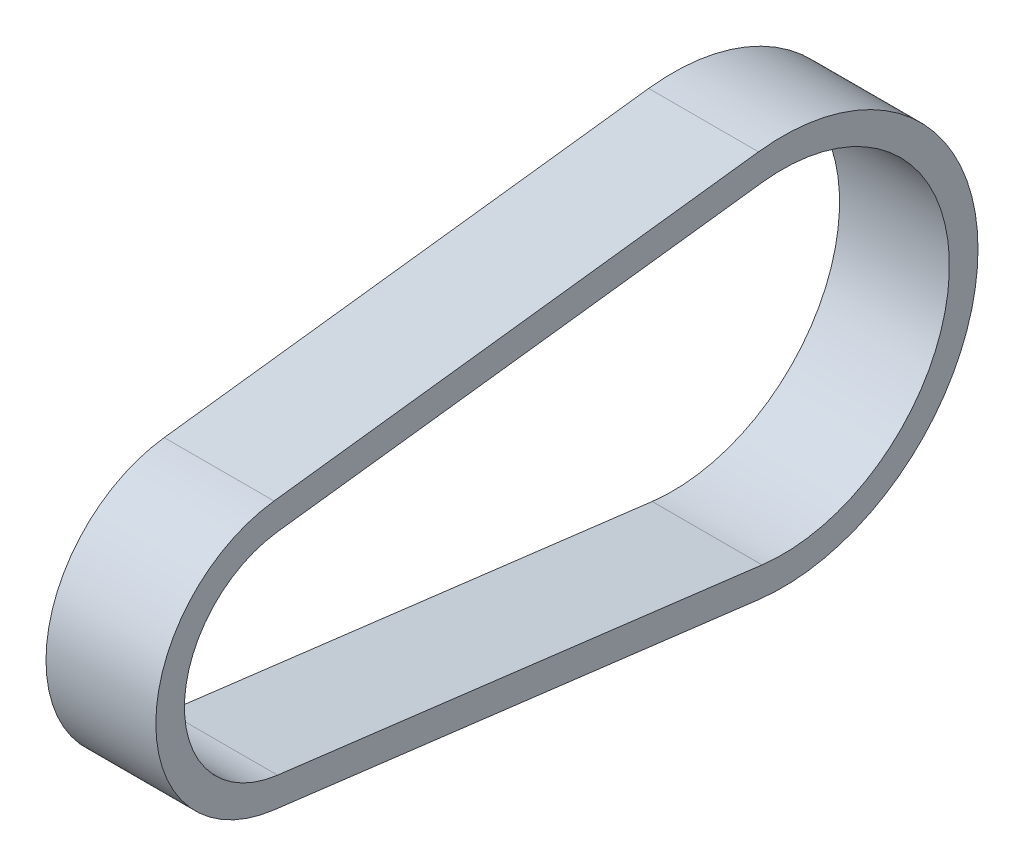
from build123d import *

# Parameters (mm, degrees)
BOSS_EXTRU_1_DEPTH = 57.6


with BuildPart() as part:
    # Esquisse1 → Boss.-Extru.1 (new body)
    with BuildSketch(Plane(origin=(0, 0, 0), x_dir=(0, 0, -1), z_dir=(1, 0, 0))):
        with BuildLine():
            Line((-8.713432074, 70.166039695), (245.368265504, 101.718677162))
            ThreePointArc((245.368265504, 101.718677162), (360.5, 0), (245.368265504, -101.718677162))
            Line((245.368265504, -101.718677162), (-8.713432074, -70.166039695))
            ThreePointArc((-8.713432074, -70.166039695), (-70.705, 0), (-8.713432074, 70.166039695))
        make_face()
        with BuildLine():
            Line((-6.864885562, 55.280379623), (247.216812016, 86.83301709))
            ThreePointArc((247.216812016, 86.83301709), (345.5, 0), (247.216812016, -86.83301709))
            Line((247.216812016, -86.83301709), (-6.864885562, -55.280379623))
            ThreePointArc((-6.864885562, -55.280379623), (-55.705, 0), (-6.864885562, 55.280379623))
        make_face(mode=Mode.SUBTRACT)
    extrude(amount=BOSS_EXTRU_1_DEPTH)


solid = part.part
